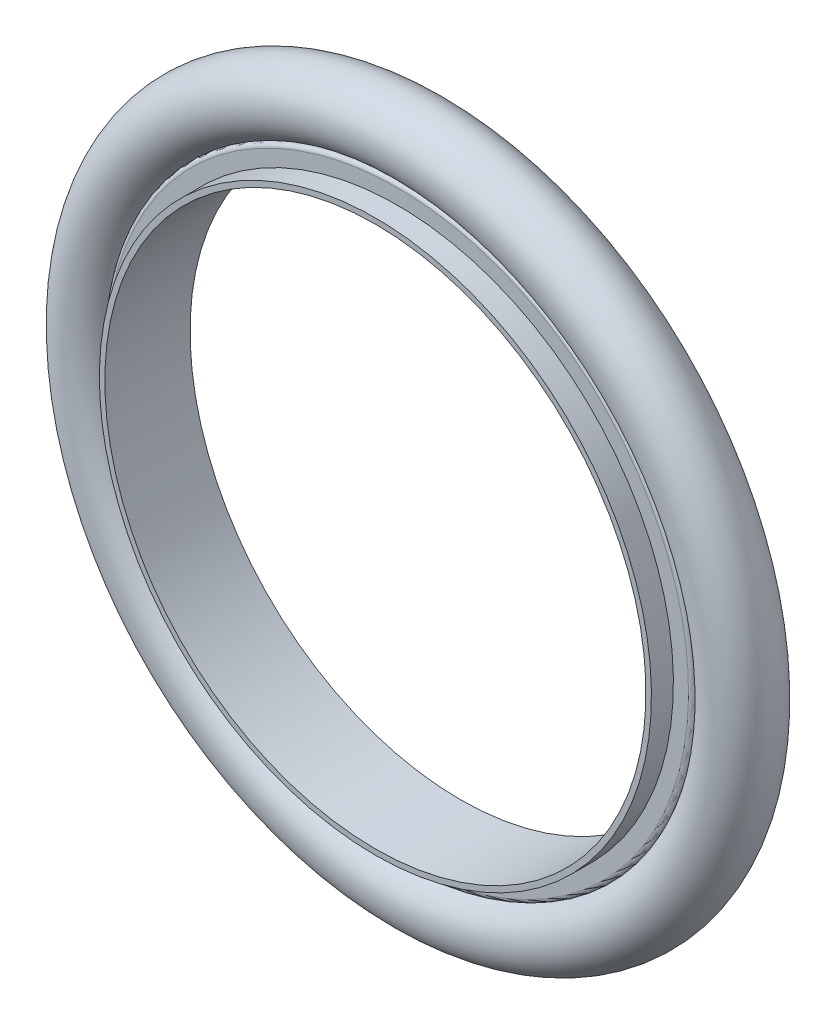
from build123d import *

# Parameters (mm, degrees)
SKETCH3_R = 3.096126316


with BuildPart() as part:
    # Sketch2 → Revolve1 (revolve)
    with BuildSketch(Plane(origin=(0, 0, 0), x_dir=(0, 0, -1), z_dir=(1, 0, 0)), mode=Mode.PRIVATE) as revolve1_sk:
        with BuildLine():
            Line((-1.905, 25.5143), (-1.905, 26.9113))
            ThreePointArc((-1.905, 26.9113), (-1.793407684, 27.180707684), (-1.524, 27.2923))
            ThreePointArc((-1.524, 27.2923), (0, 26.891247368), (1.524, 27.2923))
            ThreePointArc((1.524, 27.2923), (1.793407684, 27.180707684), (1.905, 26.9113))
            Line((1.905, 26.9113), (1.905, 25.5143))
            Line((1.905, 25.5143), (3.937, 25.5143))
            Line((3.937, 25.5143), (3.937, 25.0063))
            Line((3.937, 25.0063), (-3.937, 25.0063))
            Line((-3.937, 25.0063), (-3.937, 25.5143))
            Line((-3.937, 25.5143), (-1.905, 25.5143))
        make_face()
    revolve(revolve1_sk.sketch.rotate(Axis((0, 0, 3.937), (0, 0, -1)), 180), axis=Axis((0, 0, 3.937), (0, 0, -1)))


with BuildPart() as body_2:
    # Sketch3 → Revolve2 (revolve)
    with BuildSketch(Plane(origin=(0, 0, 0), x_dir=(0, 0, -1), z_dir=(1, 0, 0))):
        with Locations((0, 29.987373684)):
            Circle(SKETCH3_R)
    revolve(axis=Axis((0, 0, 3.937), (0, 0, -1)))


solid = Compound([part.part, body_2.part])
